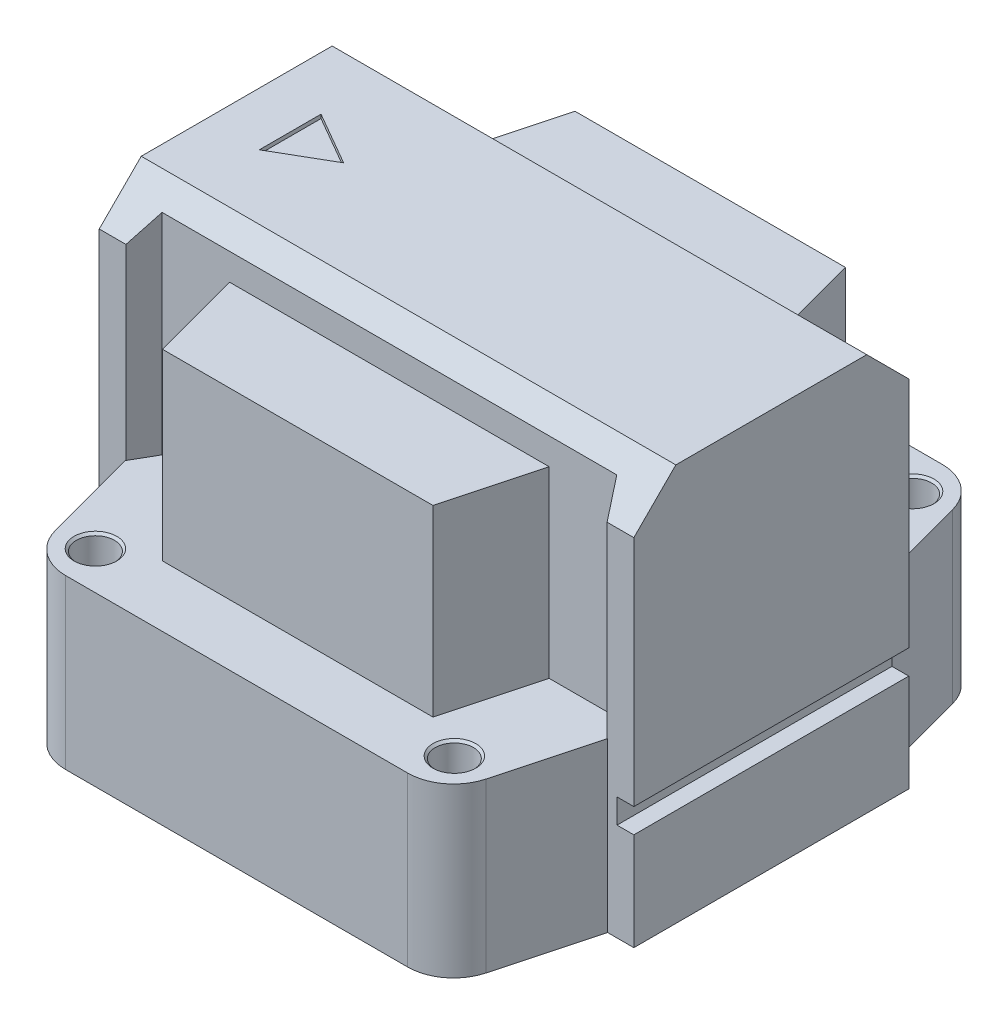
from build123d import *

# Parameters (mm, degrees)
PORT_HOUSING_DEPTH           = 35
CLAMP_ANGLES_DEPTH           = 53.009614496
CLAMP_ANGLES_DEPTH_BACK      = 53.009614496
MGT_BASE_DEPTH               = 22
MGT_BASE_ROUNDS_R            = 6
SIDE_BASE_DEPTH              = 46
INTERFACE_GROOVES_DEPTH      = 61.049979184
INTERFACE_GROOVES_DEPTH_BACK = 61.049979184
INTERFACE_GROOVES_SKETCH_W   = 2.2
INTERFACE_GROOVES_SKETCH_H   = 3.2
FLOW_ARROW_DEPTH             = 0.5
BRACKET_MGT_HOLES_AT_2_COUNT = 2
BRACKET_MGT_HOLES_AT_2_PITCH = 47
BRACKET_MGT_HOLES_AT_3_COUNT = 2
BRACKET_MGT_HOLES_AT_3_PITCH = 76.216796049
BRACKET_MGT_HOLES_AT_4_COUNT = 2
BRACKET_MGT_HOLES_AT_4_PITCH = 60
EXTRUDE1_DEPTH               = 0.381


with BuildPart() as part:
    # Port Housing_Sketch → Port Housing (new, symmetric)
    with BuildSketch(Plane(origin=(0, 0, 0), x_dir=(0, 0, -1), z_dir=(1, 0, 0))):
        Polygon((12.5, 18), (-12.5, 18), (-18, 12.5), (-18, -34), (18, -34), (18, 12.5), align=None)
    extrude(amount=PORT_HOUSING_DEPTH, both=True)

    # Clamp Angles_Sketch → Clamp Angles (cut, two sides: drawn at the far end of the back side and taken through both)
    with BuildSketch(Plane(origin=(0, 0, 0), x_dir=(1, 0, 0), z_dir=(0, 1, 0)).offset(-CLAMP_ANGLES_DEPTH_BACK)):
        Polygon((-31.5, 18), (31.5, 18), (29.767949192, 15), (-29.767949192, 15), align=None)
        Polygon((-31.5, -18), (-29.767949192, -15), (29.767949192, -15), (31.5, -18), align=None)
    extrude(amount=CLAMP_ANGLES_DEPTH + CLAMP_ANGLES_DEPTH_BACK, mode=Mode.SUBTRACT)

    # MGT Base_Sketch → MGT Base (add)
    with BuildSketch(Plane.XZ.offset(34)):
        Polygon((-27, -35), (27, -35), (32.358983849, -15), (-32.358983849, -15), align=None)
        Polygon((-27, 35), (-32.358983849, 15), (32.358983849, 15), (27, 35), align=None)
    extrude(amount=-MGT_BASE_DEPTH)

    # MGT Base Rounds
    mgt_base_rounds_edges = [part.edges().sort_by_distance(p)[0] for p in [
        (27, -23, 35),
        (-27, -23, 35),
        (-27, -23, -35),
        (27, -23, -35),
    ]]
    fillet(mgt_base_rounds_edges, radius=MGT_BASE_ROUNDS_R)

    # Side Base_Sketch → Side Base (add)
    with BuildSketch(Plane.XZ.offset(34)):
        Polygon((-17.7, -27), (17.7, -27), (20.915390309, -15), (-20.915390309, -15), align=None)
        Polygon((-17.7, 27), (-20.915390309, 15), (20.915390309, 15), (17.7, 27), align=None)
    extrude(amount=-SIDE_BASE_DEPTH)

    # Interface Grooves_Sketch → Interface Grooves (cut, two sides: drawn at the far end of the back side and taken through both)
    with BuildSketch(Plane.XY.offset(-INTERFACE_GROOVES_DEPTH_BACK)):
        with Locations((33.9, -19.6)):
            Rectangle(INTERFACE_GROOVES_SKETCH_W, INTERFACE_GROOVES_SKETCH_H)
        with Locations((-33.9, -19.6)):
            Rectangle(INTERFACE_GROOVES_SKETCH_W, INTERFACE_GROOVES_SKETCH_H)
    extrude(amount=INTERFACE_GROOVES_DEPTH + INTERFACE_GROOVES_DEPTH_BACK, mode=Mode.SUBTRACT)

    # Flow Arrow_Sketch → Flow Arrow (cut)
    with BuildSketch(Plane(origin=(-4.183308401, 18, 1.80029977), x_dir=(-1, 0, 0), z_dir=(0, 1, 0))):
        Polygon((23.816691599, -5.841751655), (23.816691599, 2.241152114), (16.816691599, -1.80029977), align=None)
    extrude(amount=-FLOW_ARROW_DEPTH, mode=Mode.SUBTRACT)

    # Profile Bracket MGT Holes → Bracket MGT Holes (revolve, cut)
    with BuildSketch(Plane(origin=(-23.5, -12, 30), x_dir=(0, 0, 1), z_dir=(1, 0, 0))):
        Polygon((0, 0), (0, 11.2618073), (2.1, 10), (2.1, 8), (2.5, 8), (2.5, 0.3), (2.8, 0), align=None)
    bracket_mgt_holes = revolve(axis=Axis((-23.5, -5.65, 30), (0, -1, 0)), mode=Mode.SUBTRACT)

    # Bracket MGT Holes at 2: Bracket MGT Holes ×2
    with Locations(*[(i * BRACKET_MGT_HOLES_AT_2_PITCH, 0, 0) for i in range(1, BRACKET_MGT_HOLES_AT_2_COUNT)]):
        add(bracket_mgt_holes, mode=Mode.SUBTRACT)

    # Bracket MGT Holes at 3: Bracket MGT Holes ×2
    with Locations(*[Vector(0.6166619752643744, 0, -0.7872280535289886) * (i * BRACKET_MGT_HOLES_AT_3_PITCH) for i in range(1, BRACKET_MGT_HOLES_AT_3_COUNT)]):
        add(bracket_mgt_holes, mode=Mode.SUBTRACT)

    # Bracket MGT Holes at 4: Bracket MGT Holes ×2
    with Locations(*[(0, 0, -i * BRACKET_MGT_HOLES_AT_4_PITCH) for i in range(1, BRACKET_MGT_HOLES_AT_4_COUNT)]):
        add(bracket_mgt_holes, mode=Mode.SUBTRACT)

    # Sketch2 → 3_8 NPT Tapped Hole1 (revolve, cut)
    with BuildSketch(Plane(origin=(-35, -0.00098, 0.00098), x_dir=(0, 0, 1), z_dir=(0, 1, 0))):
        Polygon((0, 0), (0, 21.667582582), (7.1374, 17.379), (7.1374, 10.33), (8.263205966, 10.33), (8.5725, 0), align=None)
    revolve(axis=Axis((-41.35, -0.00098, 0.00098), (1, 0, 0)), mode=Mode.SUBTRACT)

    # Sketch3 → Extrude1 (add)
    # profile 1 of 8: a face of its own
    with BuildSketch(Plane.ZY.offset(35)):
        with BuildLine():
            Line((-9.607996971, -14.03299765), (-9.159279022, -13.988125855))
            add(Edge.make_bspline(
                [(-9.159279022, -13.988125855), (-9.153297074, -14.015087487), (-9.14172245, -14.067256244), (-9.119451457, -14.14199341), (-9.095928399, -14.211366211), (-9.066767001, -14.273822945), (-9.038311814, -14.331917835), (-9.004872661, -14.383250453), (-8.969142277, -14.429160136), (-8.930460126, -14.469476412), (-8.888380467, -14.504193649), (-8.843464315, -14.534573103), (-8.794761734, -14.559944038), (-8.742645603, -14.580031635), (-8.687554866, -14.596292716), (-8.629190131, -14.608232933), (-8.567242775, -14.615345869), (-8.524782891, -14.615997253), (-8.503029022, -14.616330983)],
                knots=[0, 0, 0, 0, 1.321063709, 2.556160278, 3.730472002, 4.821700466, 5.852032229, 6.822994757, 7.746964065, 8.632786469, 9.490489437, 10.352773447, 11.223141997, 12.11199479, 13.021433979, 13.96892724, 14.959401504, 16, 16, 16, 16], degree=3))
            add(Edge.make_bspline(
                [(-8.503029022, -14.616330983), (-8.477512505, -14.615967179), (-8.427678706, -14.61525667), (-8.35506264, -14.604596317), (-8.285955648, -14.589958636), (-8.221343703, -14.567005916), (-8.16032712, -14.538953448), (-8.103253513, -14.504286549), (-8.049732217, -14.463578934), (-8.0008189, -14.416553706), (-7.957075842, -14.364824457), (-7.918116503, -14.310185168), (-7.885902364, -14.252169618), (-7.858750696, -14.191594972), (-7.838709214, -14.127482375), (-7.824037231, -14.060631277), (-7.814449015, -13.990739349), (-7.813572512, -13.943052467), (-7.813125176, -13.918714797)],
                knots=[0, 0, 0, 0, 1.111377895, 2.170522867, 3.193923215, 4.186422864, 5.152846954, 6.117443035, 7.091571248, 8.078879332, 9.069127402, 10.041602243, 10.999610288, 11.957618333, 12.930786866, 13.922135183, 14.939532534, 16, 16, 16, 16], degree=3))
            add(Edge.make_bspline(
                [(-7.813125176, -13.918714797), (-7.813650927, -13.895553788), (-7.814679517, -13.850241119), (-7.823135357, -13.783731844), (-7.837890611, -13.720596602), (-7.85834492, -13.660470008), (-7.884481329, -13.603440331), (-7.915896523, -13.549035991), (-7.95431988, -13.498449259), (-7.997568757, -13.451136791), (-8.044740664, -13.407548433), (-8.096363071, -13.370470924), (-8.150689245, -13.338471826), (-8.208366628, -13.312633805), (-8.269155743, -13.292126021), (-8.332998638, -13.277386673), (-8.400202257, -13.268927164), (-8.445980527, -13.267898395), (-8.469375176, -13.26737265)],
                knots=[0, 0, 0, 0, 1.072815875, 2.098878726, 3.09954706, 4.07199174, 5.036203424, 6.001873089, 6.97636515, 7.972747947, 8.969130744, 9.945905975, 10.911575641, 11.885646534, 12.868345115, 13.879560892, 14.916365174, 16, 16, 16, 16], degree=3))
            add(Edge.make_bspline(
                [(-8.469375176, -13.26737265), (-8.489972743, -13.267918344), (-8.533685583, -13.269076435), (-8.602679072, -13.279301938), (-8.679101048, -13.293620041), (-8.731910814, -13.307671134), (-8.759639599, -13.315048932)],
                knots=[0, 0, 0, 0, 0.837610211, 1.777604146, 2.833088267, 4, 4, 4, 4], degree=3))
            Line((-8.759639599, -13.315048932), (-8.713365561, -12.911202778))
            add(Edge.make_bspline(
                [(-8.713365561, -12.911202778), (-8.701224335, -12.912529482), (-8.679774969, -12.914873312), (-8.658217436, -12.915736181), (-8.648862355, -12.91611063)],
                knots=[0, 0, 0, 0, 1.132082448, 2, 2, 2, 2], degree=3))
            add(Edge.make_bspline(
                [(-8.648862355, -12.91611063), (-8.607595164, -12.914535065), (-8.526641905, -12.911444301), (-8.408627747, -12.885762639), (-8.296784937, -12.845327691), (-8.210379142, -12.797082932), (-8.146303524, -12.751706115), (-8.105898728, -12.710792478), (-8.069471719, -12.667374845), (-8.042294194, -12.617573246), (-8.018814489, -12.564657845), (-8.004274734, -12.506544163), (-7.993671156, -12.444644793), (-7.992971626, -12.401771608), (-7.992612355, -12.379752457)],
                knots=[0, 0, 0, 0, 1.557468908, 3.055264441, 4.54122591, 6.035034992, 6.780215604, 7.498173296, 8.201377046, 8.913174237, 9.633083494, 10.382644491, 11.169345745, 12, 12, 12, 12], degree=3))
            add(Edge.make_bspline(
                [(-7.992612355, -12.379752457), (-7.992943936, -12.361966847), (-7.993592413, -12.327183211), (-8.000816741, -12.276186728), (-8.012764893, -12.22786599), (-8.028914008, -12.181705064), (-8.050079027, -12.137945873), (-8.076325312, -12.096641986), (-8.106312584, -12.056955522), (-8.141711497, -12.020937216), (-8.179620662, -11.987121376), (-8.22142247, -11.958641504), (-8.265127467, -11.933341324), (-8.31227703, -11.914223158), (-8.361707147, -11.89850491), (-8.413840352, -11.887490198), (-8.468695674, -11.88009308), (-8.506275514, -11.879469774), (-8.52546492, -11.879151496)],
                knots=[0, 0, 0, 0, 1.041493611, 2.036867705, 3.009952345, 3.954088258, 4.897230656, 5.850851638, 6.817653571, 7.805463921, 8.805067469, 9.788883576, 10.763797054, 11.758134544, 12.762883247, 13.799594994, 14.876406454, 16, 16, 16, 16], degree=3))
            add(Edge.make_bspline(
                [(-8.52546492, -11.879151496), (-8.563018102, -11.880615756), (-8.635538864, -11.88344346), (-8.739367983, -11.909605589), (-8.83345591, -11.951939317), (-8.903114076, -12.001584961), (-8.952577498, -12.049049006), (-8.986363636, -12.089280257), (-9.016583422, -12.13370729), (-9.043322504, -12.182314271), (-9.066219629, -12.235296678), (-9.086860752, -12.291998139), (-9.102838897, -12.353326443), (-9.110485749, -12.395820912), (-9.114407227, -12.417613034)],
                knots=[0, 0, 0, 0, 1.533565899, 2.961543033, 4.347411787, 5.731829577, 6.434842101, 7.147085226, 7.87612511, 8.629021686, 9.412189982, 10.234506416, 11.094615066, 12, 12, 12, 12], degree=3))
            Line((-9.114407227, -12.417613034), (-9.563125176, -12.372741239))
            add(Edge.make_bspline(
                [(-9.563125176, -12.372741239), (-9.556105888, -12.338045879), (-9.542337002, -12.2699882), (-9.514285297, -12.171694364), (-9.480076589, -12.079424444), (-9.439003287, -11.993601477), (-9.393005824, -11.913198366), (-9.339944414, -11.839168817), (-9.281063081, -11.771072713), (-9.216257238, -11.709117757), (-9.146406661, -11.653785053), (-9.07186317, -11.606053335), (-8.993238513, -11.565593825), (-8.91045908, -11.532976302), (-8.823590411, -11.506453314), (-8.732385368, -11.488881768), (-8.637256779, -11.476995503), (-8.572478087, -11.47587566), (-8.539487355, -11.475305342)],
                knots=[0, 0, 0, 0, 1.136581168, 2.229493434, 3.279335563, 4.293305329, 5.282068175, 6.250623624, 7.213783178, 8.169396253, 9.125981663, 10.071280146, 11.007896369, 11.961295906, 12.925420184, 13.920544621, 14.940967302, 16, 16, 16, 16], degree=3))
            add(Edge.make_bspline(
                [(-8.539487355, -11.475305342), (-8.49382033, -11.476786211), (-8.404024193, -11.479698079), (-8.272134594, -11.502824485), (-8.145982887, -11.540775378), (-8.026584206, -11.593382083), (-7.915992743, -11.657666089), (-7.818128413, -11.734706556), (-7.734299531, -11.823170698), (-7.666134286, -11.922091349), (-7.612156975, -12.027412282), (-7.572215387, -12.136739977), (-7.548349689, -12.249948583), (-7.545382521, -12.32659078), (-7.543894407, -12.3650289)],
                knots=[0, 0, 0, 0, 1.104647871, 2.172094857, 3.229560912, 4.285649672, 5.322588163, 6.317201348, 7.289435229, 8.260615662, 9.214246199, 10.146367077, 11.070353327, 12, 12, 12, 12], degree=3))
            add(Edge.make_bspline(
                [(-7.543894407, -12.3650289), (-7.545403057, -12.401364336), (-7.548381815, -12.473106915), (-7.571314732, -12.578007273), (-7.610066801, -12.677388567), (-7.662445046, -12.77159948), (-7.730366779, -12.858602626), (-7.813645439, -12.936130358), (-7.910948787, -13.004924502), (-7.983869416, -13.040731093), (-8.021358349, -13.059139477)],
                knots=[0, 0, 0, 0, 0.975609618, 1.926294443, 2.868398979, 3.832526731, 4.812148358, 5.820404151, 6.879456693, 8, 8, 8, 8], degree=3))
            add(Edge.make_bspline(
                [(-8.021358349, -13.059139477), (-7.996224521, -13.065485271), (-7.946994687, -13.07791483), (-7.876289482, -13.103668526), (-7.809818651, -13.133819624), (-7.74669751, -13.167969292), (-7.688758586, -13.208356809), (-7.634004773, -13.25251598), (-7.584505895, -13.302573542), (-7.538827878, -13.356745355), (-7.497266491, -13.414464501), (-7.462292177, -13.476853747), (-7.43211036, -13.542272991), (-7.406374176, -13.611196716), (-7.387880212, -13.684156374), (-7.374656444, -13.760586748), (-7.365929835, -13.840222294), (-7.364919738, -13.894619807), (-7.364407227, -13.922220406)],
                knots=[0, 0, 0, 0, 1.053251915, 2.063013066, 3.05373318, 4.018979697, 4.975584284, 5.920798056, 6.874756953, 7.832116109, 8.799604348, 9.761196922, 10.734637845, 11.72654167, 12.747371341, 13.789206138, 14.878271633, 16, 16, 16, 16], degree=3))
            add(Edge.make_bspline(
                [(-7.364407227, -13.922220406), (-7.365261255, -13.959901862), (-7.366939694, -14.033958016), (-7.382851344, -14.142748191), (-7.408854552, -14.246983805), (-7.444839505, -14.347018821), (-7.490438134, -14.4432615), (-7.547656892, -14.534353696), (-7.614799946, -14.621035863), (-7.690817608, -14.702478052), (-7.774102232, -14.777325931), (-7.864546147, -14.842137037), (-7.960359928, -14.89717565), (-8.061699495, -14.942059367), (-8.168296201, -14.977322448), (-8.280256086, -15.002600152), (-8.397925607, -15.017456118), (-8.478213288, -15.019258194), (-8.519154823, -15.020177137)],
                knots=[0, 0, 0, 0, 1.016055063, 1.996874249, 2.958724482, 3.910019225, 4.860394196, 5.826121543, 6.806008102, 7.814207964, 8.82789325, 9.821757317, 10.810247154, 11.803791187, 12.806673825, 13.834534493, 14.895752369, 16, 16, 16, 16], degree=3))
            add(Edge.make_bspline(
                [(-8.519154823, -15.020177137), (-8.555896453, -15.019485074), (-8.628228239, -15.018122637), (-8.734107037, -15.003928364), (-8.83554443, -14.983785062), (-8.931738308, -14.952731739), (-9.023806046, -14.914862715), (-9.110188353, -14.866415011), (-9.192438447, -14.810798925), (-9.269012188, -14.746425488), (-9.339484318, -14.675374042), (-9.402353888, -14.598695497), (-9.456340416, -14.516560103), (-9.503940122, -14.430196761), (-9.542412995, -14.33797748), (-9.572370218, -14.240694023), (-9.595213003, -14.138707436), (-9.603689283, -14.068617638), (-9.607996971, -14.03299765)],
                knots=[0, 0, 0, 0, 1.08471039, 2.135426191, 3.150939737, 4.135689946, 5.116584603, 6.086901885, 7.055842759, 8.045878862, 9.036901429, 10.008421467, 10.96965771, 11.936653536, 12.917548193, 13.915472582, 14.940632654, 16, 16, 16, 16], degree=3))
        make_face()
    # profile 2 of 8: a face of its own
    with BuildSketch(Plane.ZY.offset(35)):
        Polygon((-7.140048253, -14.975305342), (-6.152868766, -11.475305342), (-5.781975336, -11.475305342), (-6.769154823, -14.975305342), align=None)
    # profile 3 of 8: a face of its own
    with BuildSketch(Plane.ZY.offset(35)):
        with BuildLine():
            add(Edge.make_bspline(
                [(-4.904871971, -13.055633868), (-4.947447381, -13.038978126), (-5.02907856, -13.007043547), (-5.139177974, -12.943133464), (-5.23235953, -12.869613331), (-5.307479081, -12.784710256), (-5.364733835, -12.69017942), (-5.405959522, -12.587226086), (-5.43010613, -12.47527669), (-5.433284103, -12.397866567), (-5.434920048, -12.358017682)],
                knots=[0, 0, 0, 0, 1.16287356, 2.229614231, 3.228817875, 4.173350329, 5.100165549, 6.029633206, 6.985702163, 8, 8, 8, 8], degree=3))
            add(Edge.make_bspline(
                [(-5.434920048, -12.358017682), (-5.434150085, -12.327355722), (-5.432638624, -12.267165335), (-5.419579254, -12.178846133), (-5.398662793, -12.094214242), (-5.36897744, -12.013508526), (-5.331786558, -11.936064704), (-5.284857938, -11.86330158), (-5.230916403, -11.793162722), (-5.167726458, -11.728483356), (-5.098092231, -11.669243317), (-5.022667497, -11.6165255), (-4.940875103, -11.573415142), (-4.854078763, -11.53737125), (-4.761849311, -11.509152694), (-4.663861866, -11.489934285), (-4.560461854, -11.477709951), (-4.48960971, -11.476119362), (-4.453349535, -11.475305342)],
                knots=[0, 0, 0, 0, 0.994101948, 1.951453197, 2.889123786, 3.817215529, 4.736003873, 5.669743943, 6.620499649, 7.601567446, 8.596478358, 9.582687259, 10.579761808, 11.589151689, 12.62747492, 13.702346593, 14.8241243, 16, 16, 16, 16], degree=3))
            add(Edge.make_bspline(
                [(-4.453349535, -11.475305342), (-4.416858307, -11.476127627), (-4.345777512, -11.477729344), (-4.241828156, -11.48978943), (-4.143222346, -11.510002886), (-4.050018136, -11.538680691), (-3.962068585, -11.575346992), (-3.87995161, -11.620414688), (-3.802821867, -11.673140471), (-3.732650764, -11.734153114), (-3.668803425, -11.800393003), (-3.613485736, -11.871358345), (-3.566041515, -11.945393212), (-3.526835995, -12.022947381), (-3.497831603, -12.104903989), (-3.475723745, -12.189718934), (-3.462900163, -12.278399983), (-3.461350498, -12.338579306), (-3.460561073, -12.36923563)],
                knots=[0, 0, 0, 0, 1.171211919, 2.281388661, 3.353996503, 4.398126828, 5.406889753, 6.407389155, 7.400009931, 8.40008733, 9.387021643, 10.349004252, 11.283445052, 12.206096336, 13.131640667, 14.068727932, 15.016178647, 16, 16, 16, 16], degree=3))
            add(Edge.make_bspline(
                [(-3.460561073, -12.36923563), (-3.461843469, -12.407711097), (-3.464358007, -12.483154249), (-3.489982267, -12.591906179), (-3.529919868, -12.693431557), (-3.587641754, -12.785795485), (-3.660744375, -12.869951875), (-3.751458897, -12.943109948), (-3.858407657, -13.006920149), (-3.937977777, -13.038958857), (-3.979391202, -13.055633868)],
                knots=[0, 0, 0, 0, 0.998680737, 1.958225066, 2.887911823, 3.823713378, 4.77537694, 5.772726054, 6.840782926, 8, 8, 8, 8], degree=3))
            add(Edge.make_bspline(
                [(-3.979391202, -13.055633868), (-3.953262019, -13.064503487), (-3.902060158, -13.081884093), (-3.829676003, -13.115677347), (-3.761528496, -13.152114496), (-3.697233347, -13.191557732), (-3.639163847, -13.236940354), (-3.585382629, -13.285579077), (-3.536115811, -13.338159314), (-3.492036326, -13.395128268), (-3.452682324, -13.455290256), (-3.418992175, -13.518791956), (-3.390379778, -13.584729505), (-3.365926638, -13.653408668), (-3.348065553, -13.725313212), (-3.335568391, -13.800112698), (-3.327639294, -13.877412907), (-3.326516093, -13.929913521), (-3.325945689, -13.956575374)],
                knots=[0, 0, 0, 0, 1.104208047, 2.163768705, 3.193778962, 4.198696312, 5.179575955, 6.14024585, 7.100368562, 8.060719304, 9.021161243, 9.975749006, 10.935506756, 11.897452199, 12.89163552, 13.897859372, 14.932451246, 16, 16, 16, 16], degree=3))
            add(Edge.make_bspline(
                [(-3.325945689, -13.956575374), (-3.32683742, -13.99332263), (-3.328594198, -14.065717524), (-3.344029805, -14.171984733), (-3.367384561, -14.274068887), (-3.401438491, -14.371538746), (-3.444933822, -14.464463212), (-3.498738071, -14.552707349), (-3.562322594, -14.636180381), (-3.633811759, -14.715141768), (-3.713736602, -14.786519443), (-3.800200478, -14.849418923), (-3.89352781, -14.902105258), (-3.992586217, -14.945729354), (-4.097850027, -14.979537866), (-4.209183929, -15.003210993), (-4.326550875, -15.017307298), (-4.406802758, -15.019207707), (-4.447740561, -15.020177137)],
                knots=[0, 0, 0, 0, 1.017598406, 2.004746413, 2.969099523, 3.915171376, 4.859468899, 5.806714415, 6.772805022, 7.762836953, 8.753334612, 9.736396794, 10.719437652, 11.716790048, 12.730404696, 13.776887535, 14.865953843, 16, 16, 16, 16], degree=3))
            add(Edge.make_bspline(
                [(-4.447740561, -15.020177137), (-4.488674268, -15.019186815), (-4.568918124, -15.01724545), (-4.686392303, -15.003437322), (-4.797566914, -14.978691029), (-4.902693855, -14.944848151), (-5.002343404, -14.902405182), (-5.095043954, -14.848531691), (-5.18207261, -14.785711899), (-5.262053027, -14.713892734), (-5.334136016, -14.634939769), (-5.396882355, -14.550233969), (-5.450367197, -14.461078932), (-5.494384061, -14.366972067), (-5.527934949, -14.267912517), (-5.55148136, -14.164272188), (-5.566944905, -14.056130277), (-5.568659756, -13.982337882), (-5.569535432, -13.944656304)],
                knots=[0, 0, 0, 0, 1.127066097, 2.209429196, 3.250843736, 4.258219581, 5.246860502, 6.227045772, 7.204057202, 8.19754525, 9.181483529, 10.142920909, 11.095356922, 12.039670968, 12.998174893, 13.969127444, 14.962948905, 16, 16, 16, 16], degree=3))
            add(Edge.make_bspline(
                [(-5.569535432, -13.944656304), (-5.568926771, -13.916599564), (-5.567732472, -13.861547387), (-5.560436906, -13.780800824), (-5.545896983, -13.703840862), (-5.527168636, -13.630213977), (-5.503389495, -13.559735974), (-5.474053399, -13.492960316), (-5.438461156, -13.430048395), (-5.398026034, -13.370590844), (-5.352237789, -13.315005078), (-5.301838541, -13.263777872), (-5.246645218, -13.217491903), (-5.187898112, -13.174795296), (-5.123134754, -13.138708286), (-5.054763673, -13.10559173), (-4.981609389, -13.077349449), (-4.930707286, -13.062944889), (-4.904871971, -13.055633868)],
                knots=[0, 0, 0, 0, 1.117345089, 2.192424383, 3.22371675, 4.232639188, 5.215561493, 6.182180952, 7.132172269, 8.089790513, 9.041830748, 9.996006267, 10.94686322, 11.907506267, 12.882866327, 13.894317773, 14.931262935, 16, 16, 16, 16], degree=3))
        make_face()
        with BuildLine():
            add(Edge.make_bspline(
                [(-4.986202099, -12.360121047), (-4.984870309, -12.395842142), (-4.982296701, -12.464871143), (-4.954308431, -12.562921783), (-4.910542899, -12.650998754), (-4.859235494, -12.714870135), (-4.810044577, -12.75838901), (-4.768987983, -12.787445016), (-4.724121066, -12.812112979), (-4.675118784, -12.831286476), (-4.623167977, -12.848273), (-4.566476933, -12.857767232), (-4.506378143, -12.865485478), (-4.464830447, -12.866044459), (-4.44353383, -12.866330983)],
                knots=[0, 0, 0, 0, 1.528727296, 2.954179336, 4.335216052, 5.725683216, 6.435919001, 7.148062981, 7.879427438, 8.626027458, 9.402978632, 10.2190538, 11.08711833, 12, 12, 12, 12], degree=3))
            add(Edge.make_bspline(
                [(-4.44353383, -12.866330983), (-4.422707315, -12.866033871), (-4.382096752, -12.86545452), (-4.323351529, -12.857893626), (-4.267837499, -12.847795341), (-4.216374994, -12.832492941), (-4.168369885, -12.812595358), (-4.124602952, -12.788066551), (-4.083764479, -12.759875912), (-4.036018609, -12.716024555), (-3.984782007, -12.654390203), (-3.940869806, -12.570247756), (-3.913505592, -12.478190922), (-3.910712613, -12.414067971), (-3.909279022, -12.381154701)],
                knots=[0, 0, 0, 0, 0.922112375, 1.798068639, 2.620552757, 3.419964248, 4.17189205, 4.918165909, 5.639229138, 6.36503528, 7.785020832, 9.165298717, 10.544993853, 12, 12, 12, 12], degree=3))
            add(Edge.make_bspline(
                [(-3.909279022, -12.381154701), (-3.911006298, -12.347090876), (-3.914386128, -12.280436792), (-3.941683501, -12.184751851), (-3.987641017, -12.09808987), (-4.040141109, -12.034801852), (-4.0887316, -11.98895341), (-4.130303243, -11.959767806), (-4.174992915, -11.934928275), (-4.222970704, -11.914643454), (-4.274305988, -11.898283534), (-4.329137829, -11.887550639), (-4.387235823, -11.880023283), (-4.427147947, -11.879448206), (-4.447740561, -11.879151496)],
                knots=[0, 0, 0, 0, 1.480633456, 2.897216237, 4.289382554, 5.720567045, 6.454675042, 7.191244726, 7.924224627, 8.676083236, 9.454506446, 10.26432127, 11.104478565, 12, 12, 12, 12], degree=3))
            add(Edge.make_bspline(
                [(-4.447740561, -11.879151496), (-4.468335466, -11.87943861), (-4.508484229, -11.879998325), (-4.566961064, -11.887751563), (-4.622312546, -11.897489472), (-4.674028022, -11.913117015), (-4.721892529, -11.93353858), (-4.766406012, -11.958392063), (-4.807898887, -11.986832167), (-4.856830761, -12.030636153), (-4.908078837, -12.092271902), (-4.95322695, -12.175070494), (-4.981129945, -12.265348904), (-4.98449044, -12.328139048), (-4.986202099, -12.360121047)],
                knots=[0, 0, 0, 0, 0.914830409, 1.783417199, 2.618873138, 3.411020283, 4.179090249, 4.927874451, 5.674348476, 6.410336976, 7.841713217, 9.213201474, 10.580551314, 12, 12, 12, 12], degree=3))
        make_face(mode=Mode.SUBTRACT)
        with BuildLine():
            add(Edge.make_bspline(
                [(-5.120817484, -13.936242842), (-5.120041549, -13.965035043), (-5.118487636, -14.022695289), (-5.104856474, -14.108332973), (-5.081727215, -14.192375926), (-5.052083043, -14.274903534), (-5.010268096, -14.352584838), (-4.954816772, -14.421921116), (-4.885235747, -14.480214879), (-4.805770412, -14.529463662), (-4.719053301, -14.56822669), (-4.628691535, -14.5952846), (-4.537017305, -14.613163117), (-4.475165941, -14.615274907), (-4.444234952, -14.616330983)],
                knots=[0, 0, 0, 0, 0.957879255, 1.91828174, 2.876792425, 3.856375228, 4.831004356, 5.799187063, 6.79220414, 7.836856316, 8.902268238, 9.943090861, 10.971368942, 12, 12, 12, 12], degree=3))
            add(Edge.make_bspline(
                [(-4.444234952, -14.616330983), (-4.418729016, -14.615898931), (-4.369178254, -14.615059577), (-4.296948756, -14.605468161), (-4.22889224, -14.590914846), (-4.164696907, -14.570959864), (-4.105307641, -14.543660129), (-4.049757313, -14.511752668), (-3.998614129, -14.473190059), (-3.95189257, -14.429180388), (-3.910068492, -14.380497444), (-3.87424088, -14.327979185), (-3.842988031, -14.273102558), (-3.817471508, -14.214683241), (-3.79901895, -14.152600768), (-3.784780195, -14.087975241), (-3.776190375, -14.020140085), (-3.775179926, -13.973894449), (-3.774663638, -13.950265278)],
                knots=[0, 0, 0, 0, 1.149387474, 2.232932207, 3.278773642, 4.285224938, 5.256757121, 6.220082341, 7.168479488, 8.137608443, 9.109140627, 10.056190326, 10.999892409, 11.953252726, 12.923240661, 13.915357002, 14.934853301, 16, 16, 16, 16], degree=3))
            add(Edge.make_bspline(
                [(-3.774663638, -13.950265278), (-3.775196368, -13.926172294), (-3.776239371, -13.879002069), (-3.784610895, -13.809678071), (-3.799648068, -13.743915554), (-3.818985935, -13.68072104), (-3.845194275, -13.62119393), (-3.876653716, -13.564480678), (-3.915178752, -13.512076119), (-3.957424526, -13.46220111), (-4.005232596, -13.417052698), (-4.058027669, -13.378119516), (-4.114136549, -13.343734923), (-4.175256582, -13.317359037), (-4.240041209, -13.296231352), (-4.308798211, -13.280879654), (-4.381807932, -13.271495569), (-4.431819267, -13.2706251), (-4.457556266, -13.270177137)],
                knots=[0, 0, 0, 0, 1.065858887, 2.086781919, 3.082735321, 4.047496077, 5.006086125, 5.955204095, 6.910833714, 7.878747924, 8.844339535, 9.812198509, 10.776903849, 11.749116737, 12.749729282, 13.788304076, 14.861809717, 16, 16, 16, 16], degree=3))
            add(Edge.make_bspline(
                [(-4.457556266, -13.270177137), (-4.482594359, -13.270629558), (-4.531676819, -13.271516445), (-4.602980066, -13.280953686), (-4.670482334, -13.295446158), (-4.733589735, -13.31665782), (-4.793091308, -13.343163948), (-4.847898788, -13.376493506), (-4.898989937, -13.415179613), (-4.944804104, -13.460144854), (-4.986140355, -13.50898933), (-5.02187997, -13.561350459), (-5.053452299, -13.616013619), (-5.077411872, -13.674772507), (-5.097691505, -13.735727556), (-5.110369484, -13.800061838), (-5.119381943, -13.867044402), (-5.120331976, -13.912839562), (-5.120817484, -13.936242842)],
                knots=[0, 0, 0, 0, 1.135239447, 2.225422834, 3.256957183, 4.262780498, 5.240265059, 6.205773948, 7.16638056, 8.141101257, 9.111719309, 10.064571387, 11.014055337, 11.969087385, 12.938082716, 13.92369833, 14.938921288, 16, 16, 16, 16], degree=3))
        make_face(mode=Mode.SUBTRACT)
    # profile 4 of 8: a face of its own
    with BuildSketch(Plane.ZY.offset(35)):
        Polygon((-1.466570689, -12.731715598), (-1.575945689, -12.05653531), (-1.575945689, -11.475305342), (-1.12722774, -11.475305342), (-1.12722774, -12.05653531), (-1.225384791, -12.731715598), align=None)
    # profile 5 of 8: a face of its own
    with BuildSketch(Plane.ZY.offset(35)):
        Polygon((-0.616109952, -12.731715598), (-0.723381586, -12.05653531), (-0.723381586, -11.475305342), (-0.274663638, -11.475305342), (-0.274663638, -12.05653531), (-0.379831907, -12.731715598), align=None)
    # profile 6 of 8: a face of its own
    with BuildSketch(Plane.ZY.offset(35)):
        Polygon((1.699695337, -14.975305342), (1.699695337, -11.475305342), (2.221329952, -11.475305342), (3.898413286, -14.086984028), (3.898413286, -11.475305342), (4.392003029, -11.475305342), (4.392003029, -14.975305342), (3.870368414, -14.975305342), (2.19328508, -12.363626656), (2.19328508, -14.975305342), align=None)
    # profile 7 of 8: a face of its own
    with BuildSketch(Plane.ZY.offset(35)):
        with BuildLine():
            Line((5.199695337, -14.975305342), (5.199695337, -11.475305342))
            Line((5.199695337, -11.475305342), (6.485552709, -11.475305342))
            add(Edge.make_bspline(
                [(6.485552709, -11.475305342), (6.53885046, -11.475608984), (6.638943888, -11.476179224), (6.778723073, -11.482857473), (6.89875373, -11.491119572), (6.971252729, -11.502882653), (7.004382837, -11.508258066)],
                knots=[0, 0, 0, 0, 1.22865052, 2.30741144, 3.226532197, 4, 4, 4, 4], degree=3))
            add(Edge.make_bspline(
                [(7.004382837, -11.508258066), (7.044793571, -11.516035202), (7.123120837, -11.53110946), (7.234020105, -11.567450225), (7.335055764, -11.612673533), (7.426069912, -11.669017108), (7.508574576, -11.735207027), (7.581393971, -11.814518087), (7.645942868, -11.905179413), (7.700829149, -12.007120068), (7.746513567, -12.116808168), (7.778511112, -12.233663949), (7.799005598, -12.3556572), (7.801162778, -12.439030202), (7.802259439, -12.481415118)],
                knots=[0, 0, 0, 0, 1.070909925, 2.075721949, 3.031861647, 3.947440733, 4.85625699, 5.777986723, 6.742441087, 7.747548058, 8.78749499, 9.830146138, 10.896896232, 12, 12, 12, 12], degree=3))
            add(Edge.make_bspline(
                [(7.802259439, -12.481415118), (7.801486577, -12.517679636), (7.799965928, -12.589032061), (7.786908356, -12.693859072), (7.766313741, -12.794706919), (7.73559408, -12.890885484), (7.69803847, -12.983519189), (7.650709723, -13.071045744), (7.595443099, -13.154653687), (7.532035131, -13.234115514), (7.457386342, -13.307818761), (7.367574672, -13.370341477), (7.264331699, -13.422842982), (7.147633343, -13.465263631), (7.017762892, -13.498641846), (6.874294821, -13.523097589), (6.716949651, -13.536599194), (6.607573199, -13.538447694), (6.550757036, -13.539407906)],
                knots=[0, 0, 0, 0, 0.928769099, 1.82740408, 2.702266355, 3.562020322, 4.410419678, 5.259600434, 6.10654066, 6.975254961, 7.860221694, 8.783881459, 9.766664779, 10.81996744, 11.958551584, 13.197863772, 14.544415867, 16, 16, 16, 16], degree=3))
            Line((6.550757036, -13.539407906), (5.69328508, -13.539407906))
            Line((5.69328508, -13.539407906), (5.69328508, -14.975305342))
            Line((5.69328508, -14.975305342), (5.199695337, -14.975305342))
        make_face()
        with BuildLine():
            Line((5.69328508, -13.135561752), (6.537435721, -13.135561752))
            add(Edge.make_bspline(
                [(6.537435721, -13.135561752), (6.571103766, -13.13499881), (6.635962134, -13.133914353), (6.729679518, -13.126346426), (6.815688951, -13.113246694), (6.894229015, -13.094976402), (6.965399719, -13.072266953), (7.029073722, -13.043545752), (7.084922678, -13.009093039), (7.133316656, -12.96925989), (7.174857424, -12.924637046), (7.210851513, -12.875955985), (7.241434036, -12.822868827), (7.26540712, -12.76515346), (7.285715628, -12.70393256), (7.298391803, -12.637937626), (7.307205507, -12.568125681), (7.30817479, -12.520006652), (7.308669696, -12.495437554)],
                knots=[0, 0, 0, 0, 1.403696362, 2.704090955, 3.91683431, 5.027708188, 6.063065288, 7.026749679, 7.932587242, 8.790956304, 9.632005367, 10.468072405, 11.310475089, 12.179234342, 13.069796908, 13.994719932, 14.976123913, 16, 16, 16, 16], degree=3))
            add(Edge.make_bspline(
                [(7.308669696, -12.495437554), (7.307624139, -12.459808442), (7.305598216, -12.390771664), (7.285186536, -12.291429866), (7.253185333, -12.199636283), (7.207369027, -12.117128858), (7.151917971, -12.04474787), (7.08673643, -11.985528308), (7.013914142, -11.93818445), (6.959541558, -11.919438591), (6.932167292, -11.910000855)],
                knots=[0, 0, 0, 0, 1.143156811, 2.215038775, 3.243253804, 4.254666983, 5.233799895, 6.158487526, 7.072877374, 8, 8, 8, 8], degree=3))
            add(Edge.make_bspline(
                [(6.932167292, -11.910000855), (6.922141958, -11.907549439), (6.900356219, -11.902222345), (6.864268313, -11.896176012), (6.822444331, -11.890450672), (6.774680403, -11.886652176), (6.721412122, -11.882879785), (6.662476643, -11.881140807), (6.59773971, -11.879638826), (6.552627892, -11.879318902), (6.52902226, -11.879151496)],
                knots=[0, 0, 0, 0, 0.611063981, 1.327884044, 2.165719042, 3.110592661, 4.16481496, 5.328235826, 6.601947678, 8, 8, 8, 8], degree=3))
            Line((6.52902226, -11.879151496), (5.69328508, -11.879151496))
            Line((5.69328508, -11.879151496), (5.69328508, -13.135561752))
        make_face(mode=Mode.SUBTRACT)
    # profile 8 of 8: a face of its own
    with BuildSketch(Plane.ZY.offset(35)):
        Polygon((9.28302867, -14.975305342), (9.28302867, -11.879151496), (8.161233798, -11.879151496), (8.161233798, -11.475305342), (10.898413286, -11.475305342), (10.898413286, -11.879151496), (9.776618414, -11.879151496), (9.776618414, -14.975305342), align=None)
    extrude(amount=EXTRUDE1_DEPTH)


solid = part.part
